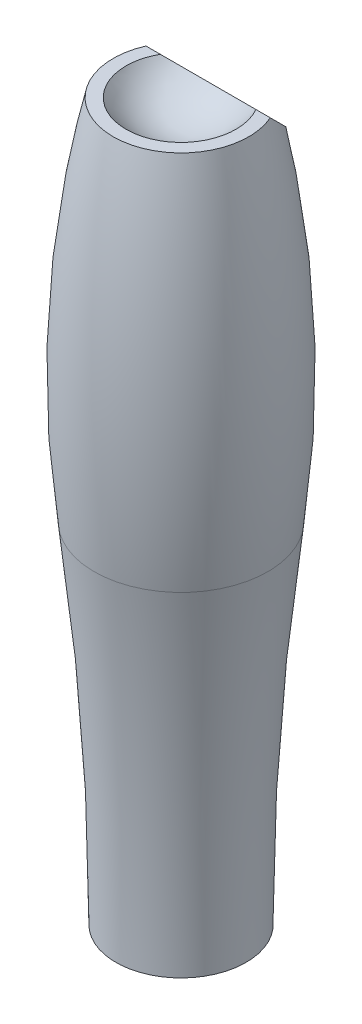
from build123d import *


with BuildPart() as part:
    # Skica1 → Oto_it kolem osy1 (revolve)
    with BuildSketch(Plane.XY, mode=Mode.PRIVATE) as oto_it_kolem_osy1_sk:
        with BuildLine():
            Line((0, 0), (0, 379.5))
            Line((0, 379.5), (35.9375, 379.5))
            ThreePointArc((35.9375, 379.5), (49.567453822, 282.695223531), (46.02010445, 185))
            ThreePointArc((46.02010445, 185), (37.382812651, 92.67916811), (34.5, 0))
            Line((34.5, 0), (0, 0))
        make_face()
    revolve(oto_it_kolem_osy1_sk.sketch.rotate(Axis((0, 0, 0), (0, 1, 0)), 90), axis=Axis((0, 0, 0), (0, 1, 0)))

    # Skica2 → Odebrat oto_en_m1 (revolve, cut)
    with BuildSketch(Plane.XY, mode=Mode.PRIVATE) as odebrat_oto_en_m1_sk:
        with BuildLine():
            Line((0, 363.5), (0, 398))
            Line((0, 398), (-34.5, 398))
            ThreePointArc((-34.5, 398), (-24.395183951, 373.604816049), (0, 363.5))
        make_face()
    revolve(odebrat_oto_en_m1_sk.sketch.rotate(Axis((0, 363.5, 0), (0, 1, 0)), 270), axis=Axis((0, 363.5, 0), (0, 1, 0)), mode=Mode.SUBTRACT)

    # Skica3 → Odebrat oto_en_m2 (revolve, cut)
    with BuildSketch(Plane.XY):
        with BuildLine():
            Line((0, -5), (0, 23.75))
            ThreePointArc((0, 23.75), (-20.329319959, 15.329319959), (-28.75, -5))
            Line((-28.75, -5), (0, -5))
        make_face()
    revolve(axis=Axis((0, -5, 0), (0, 1, 0)), mode=Mode.SUBTRACT)

    # Odebrat povrchem1
    split(bisect_by=Plane(origin=(0, 196.94, -196.94), x_dir=(-1, 0, 0), z_dir=(0, 0.707106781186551, -0.7071067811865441)), keep=Keep.BOTTOM)


solid = part.part
